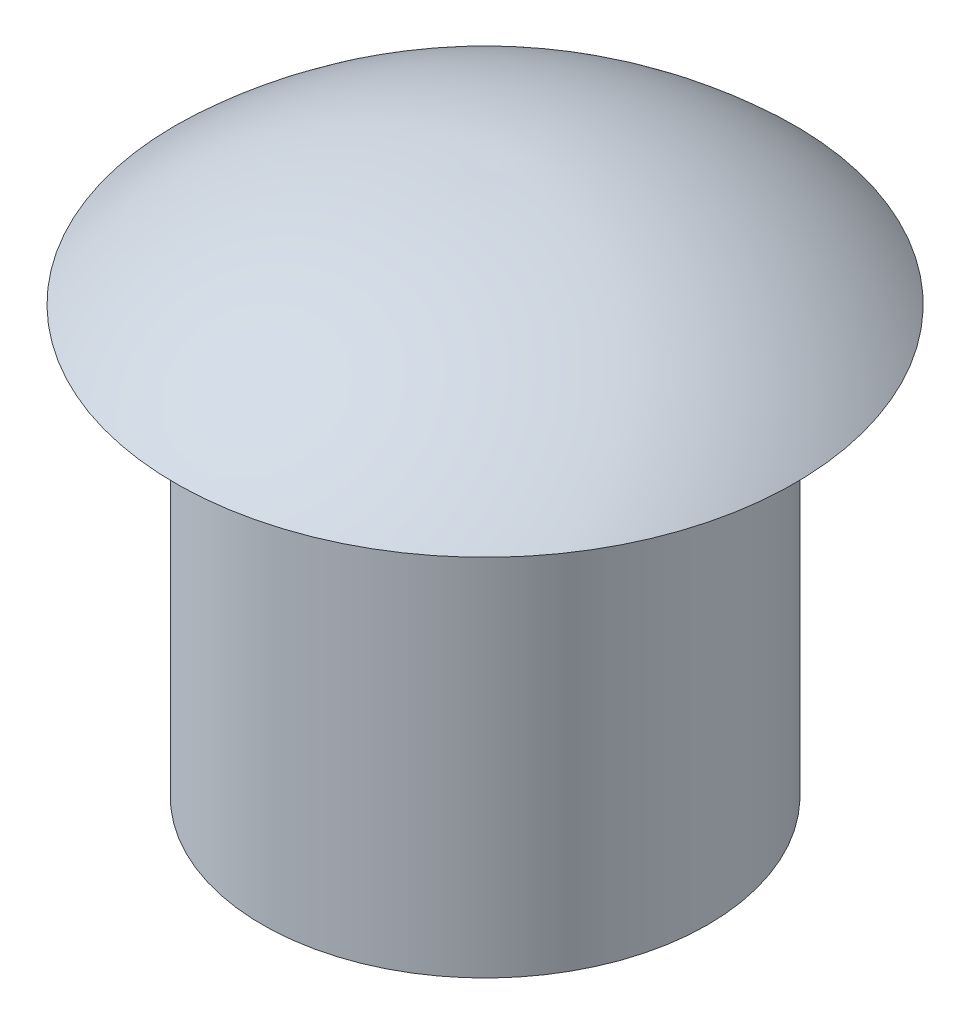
ISO-10303-21;
HEADER;
FILE_DESCRIPTION(('STEP AP214'),'2;1');
FILE_NAME('part.step','',(''),(''),'','','');
FILE_SCHEMA(('AUTOMOTIVE_DESIGN { 1 0 10303 214 1 1 1 1 }'));
ENDSEC;
DATA;
#1=APPLICATION_CONTEXT('core data for automotive mechanical design processes');
#2=APPLICATION_PROTOCOL_DEFINITION('international standard','automotive_design',2000,#1);
#3=PRODUCT_CONTEXT('',#1,'mechanical');
#4=PRODUCT('Part','Part','',(#3));
#5=PRODUCT_RELATED_PRODUCT_CATEGORY('part','',(#4));
#6=PRODUCT_DEFINITION_FORMATION('','',#4);
#7=PRODUCT_DEFINITION_CONTEXT('part definition',#1,'design');
#8=PRODUCT_DEFINITION('design','',#6,#7);
#9=PRODUCT_DEFINITION_SHAPE('','',#8);
#10=(LENGTH_UNIT() NAMED_UNIT(*) SI_UNIT(.MILLI.,.METRE.));
#11=(NAMED_UNIT(*) PLANE_ANGLE_UNIT() SI_UNIT($,.RADIAN.));
#12=(NAMED_UNIT(*) SI_UNIT($,.STERADIAN.) SOLID_ANGLE_UNIT());
#13=UNCERTAINTY_MEASURE_WITH_UNIT(LENGTH_MEASURE(1.E-05),#10,'distance_accuracy_value','');
#14=(GEOMETRIC_REPRESENTATION_CONTEXT(3) GLOBAL_UNCERTAINTY_ASSIGNED_CONTEXT((#13)) GLOBAL_UNIT_ASSIGNED_CONTEXT((#10,
#11,#12)) REPRESENTATION_CONTEXT('',''));
#15=CARTESIAN_POINT('',(0.,0.,0.));
#16=DIRECTION('',(0.,0.,1.));
#17=DIRECTION('',(1.,0.,0.));
#18=AXIS2_PLACEMENT_3D('',#15,#16,#17);
#19=CARTESIAN_POINT('',(1.,-1.5,0.));
#20=DIRECTION('',(0.,-1.,0.));
#21=DIRECTION('',(0.,0.,-1.));
#22=AXIS2_PLACEMENT_3D('',#19,#20,#21);
#23=PLANE('',#22);
#24=CARTESIAN_POINT('',(0.,-1.5,0.));
#25=DIRECTION('',(0.,-1.,0.));
#26=DIRECTION('',(1.,0.,0.));
#27=AXIS2_PLACEMENT_3D('',#24,#25,#26);
#28=CIRCLE('',#27,2.);
#29=CARTESIAN_POINT('',(2.,-1.5,0.));
#30=VERTEX_POINT('',#29);
#31=EDGE_CURVE('E19',#30,#30,#28,.T.);
#32=ORIENTED_EDGE('',*,*,#31,.T.);
#33=EDGE_LOOP('',(#32));
#34=FACE_BOUND('',#33,.T.);
#35=ADVANCED_FACE('F15',(#34),#23,.T.);
#36=CARTESIAN_POINT('',(0.,-4.25,0.));
#37=DIRECTION('',(0.,-1.,0.));
#38=DIRECTION('',(1.,0.,0.));
#39=AXIS2_PLACEMENT_3D('',#36,#37,#38);
#40=CYLINDRICAL_SURFACE('',#39,2.);
#41=CARTESIAN_POINT('',(0.,-7.,0.));
#42=DIRECTION('',(0.,-1.,0.));
#43=DIRECTION('',(1.,0.,0.));
#44=AXIS2_PLACEMENT_3D('',#41,#42,#43);
#45=CIRCLE('',#44,2.);
#46=CARTESIAN_POINT('',(2.,-7.,0.));
#47=VERTEX_POINT('',#46);
#48=EDGE_CURVE('E35',#47,#47,#45,.F.);
#49=ORIENTED_EDGE('',*,*,#48,.F.);
#50=EDGE_LOOP('',(#49));
#51=FACE_BOUND('',#50,.T.);
#52=ORIENTED_EDGE('',*,*,#31,.F.);
#53=EDGE_LOOP('',(#52));
#54=FACE_BOUND('',#53,.T.);
#55=ADVANCED_FACE('F30',(#51,#54),#40,.F.);
#56=CARTESIAN_POINT('',(-0.178618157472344,-5.60701824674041,0.));
#57=DIRECTION('',(0.,0.,-1.));
#58=DIRECTION('',(-1.,0.,0.));
#59=AXIS2_PLACEMENT_3D('',#56,#57,#58);
#60=CIRCLE('',#59,5.60986257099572);
#61=TRIMMED_CURVE('',#60,(PARAMETER_VALUE(-1.60264173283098)),
(PARAMETER_VALUE(1.60264173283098)),.T.,.PARAMETER.);
#62=CARTESIAN_POINT('',(0.,-5.60701824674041,0.));
#63=DIRECTION('',(0.,1.,0.));
#64=AXIS1_PLACEMENT('',#62,#63);
#65=SURFACE_OF_REVOLUTION('',#61,#64);
#66=CARTESIAN_POINT('',(0.,0.,0.));
#67=VERTEX_POINT('',#66);
#68=VERTEX_LOOP('',#67);
#69=FACE_BOUND('',#68,.T.);
#70=CARTESIAN_POINT('',(0.,-1.5,0.));
#71=DIRECTION('',(0.,1.,0.));
#72=DIRECTION('',(-1.,0.,0.));
#73=AXIS2_PLACEMENT_3D('',#70,#71,#72);
#74=CIRCLE('',#73,4.);
#75=CARTESIAN_POINT('',(-4.,-1.5,0.));
#76=VERTEX_POINT('',#75);
#77=EDGE_CURVE('E33',#76,#76,#74,.F.);
#78=ORIENTED_EDGE('',*,*,#77,.F.);
#79=EDGE_LOOP('',(#78));
#80=FACE_BOUND('',#79,.T.);
#81=ADVANCED_FACE('F17',(#69,#80),#65,.T.);
#82=CARTESIAN_POINT('',(2.4375,-7.,0.));
#83=DIRECTION('',(0.,-1.,0.));
#84=DIRECTION('',(0.,0.,-1.));
#85=AXIS2_PLACEMENT_3D('',#82,#83,#84);
#86=PLANE('',#85);
#87=ORIENTED_EDGE('',*,*,#48,.T.);
#88=EDGE_LOOP('',(#87));
#89=FACE_BOUND('',#88,.T.);
#90=CARTESIAN_POINT('',(0.,-7.,0.));
#91=DIRECTION('',(0.,-1.,0.));
#92=DIRECTION('',(1.,0.,0.));
#93=AXIS2_PLACEMENT_3D('',#90,#91,#92);
#94=CIRCLE('',#93,2.875);
#95=CARTESIAN_POINT('',(2.875,-7.,0.));
#96=VERTEX_POINT('',#95);
#97=EDGE_CURVE('E23',#96,#96,#94,.F.);
#98=ORIENTED_EDGE('',*,*,#97,.F.);
#99=EDGE_LOOP('',(#98));
#100=FACE_BOUND('',#99,.T.);
#101=ADVANCED_FACE('F29',(#89,#100),#86,.T.);
#102=CARTESIAN_POINT('',(3.4375,-1.5,0.));
#103=DIRECTION('',(0.,-1.,0.));
#104=DIRECTION('',(0.,0.,-1.));
#105=AXIS2_PLACEMENT_3D('',#102,#103,#104);
#106=PLANE('',#105);
#107=CARTESIAN_POINT('',(0.,-1.5,0.));
#108=DIRECTION('',(0.,-1.,0.));
#109=DIRECTION('',(1.,0.,0.));
#110=AXIS2_PLACEMENT_3D('',#107,#108,#109);
#111=CIRCLE('',#110,2.875);
#112=CARTESIAN_POINT('',(2.875,-1.5,0.));
#113=VERTEX_POINT('',#112);
#114=EDGE_CURVE('E10',#113,#113,#111,.T.);
#115=ORIENTED_EDGE('',*,*,#114,.F.);
#116=EDGE_LOOP('',(#115));
#117=FACE_BOUND('',#116,.T.);
#118=ORIENTED_EDGE('',*,*,#77,.T.);
#119=EDGE_LOOP('',(#118));
#120=FACE_BOUND('',#119,.T.);
#121=ADVANCED_FACE('F56',(#117,#120),#106,.T.);
#122=CARTESIAN_POINT('',(0.,-4.25,0.));
#123=DIRECTION('',(0.,-1.,0.));
#124=DIRECTION('',(1.,0.,0.));
#125=AXIS2_PLACEMENT_3D('',#122,#123,#124);
#126=CYLINDRICAL_SURFACE('',#125,2.875);
#127=ORIENTED_EDGE('',*,*,#114,.T.);
#128=EDGE_LOOP('',(#127));
#129=FACE_BOUND('',#128,.T.);
#130=ORIENTED_EDGE('',*,*,#97,.T.);
#131=EDGE_LOOP('',(#130));
#132=FACE_BOUND('',#131,.T.);
#133=ADVANCED_FACE('F54',(#129,#132),#126,.T.);
#134=CLOSED_SHELL('',(#35,#55,#81,#101,#121,#133));
#135=MANIFOLD_SOLID_BREP('B1',#134);
#136=ADVANCED_BREP_SHAPE_REPRESENTATION('',(#18,#135),#14);
#137=SHAPE_DEFINITION_REPRESENTATION(#9,#136);
ENDSEC;
END-ISO-10303-21;
